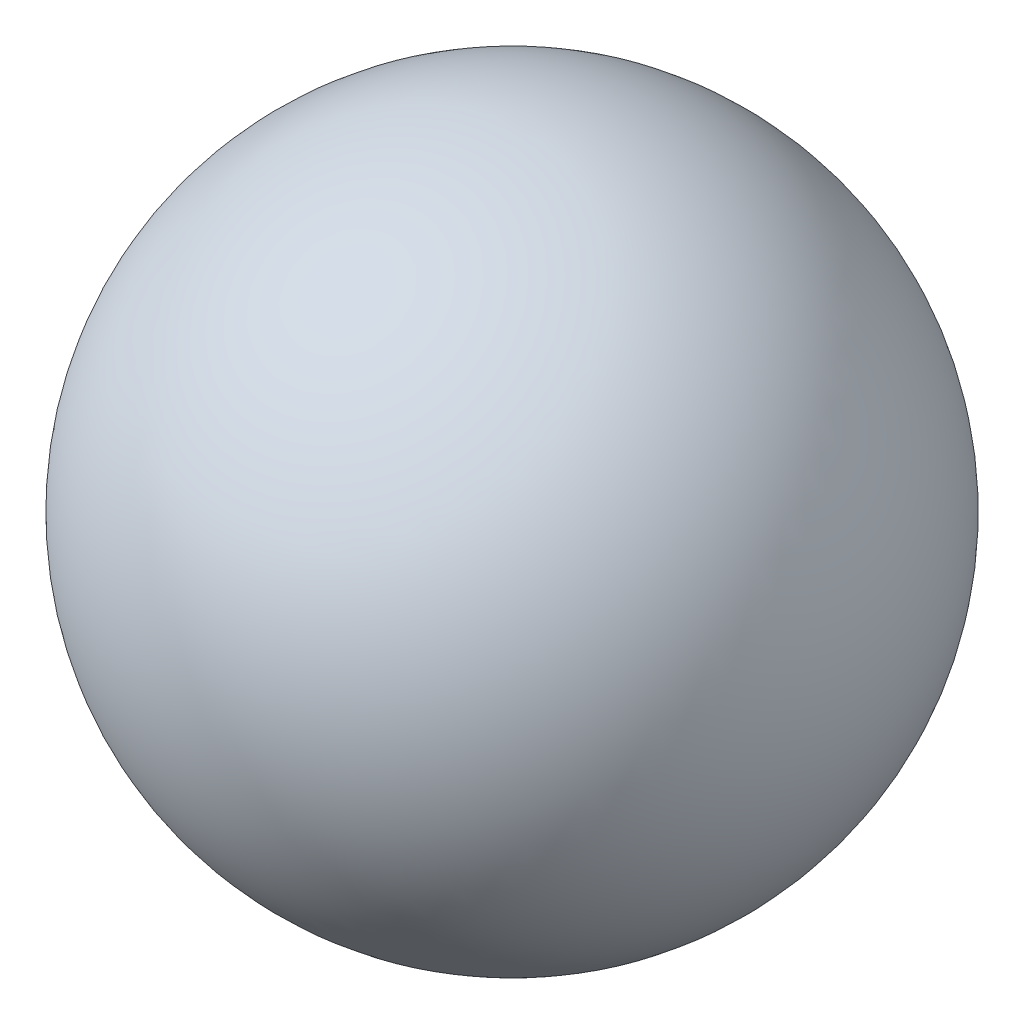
ISO-10303-21;
HEADER;
FILE_DESCRIPTION(('STEP AP214'),'2;1');
FILE_NAME('part.step','',(''),(''),'','','');
FILE_SCHEMA(('AUTOMOTIVE_DESIGN { 1 0 10303 214 1 1 1 1 }'));
ENDSEC;
DATA;
#1=APPLICATION_CONTEXT('core data for automotive mechanical design processes');
#2=APPLICATION_PROTOCOL_DEFINITION('international standard','automotive_design',2000,#1);
#3=PRODUCT_CONTEXT('',#1,'mechanical');
#4=PRODUCT('Part','Part','',(#3));
#5=PRODUCT_RELATED_PRODUCT_CATEGORY('part','',(#4));
#6=PRODUCT_DEFINITION_FORMATION('','',#4);
#7=PRODUCT_DEFINITION_CONTEXT('part definition',#1,'design');
#8=PRODUCT_DEFINITION('design','',#6,#7);
#9=PRODUCT_DEFINITION_SHAPE('','',#8);
#10=(LENGTH_UNIT() NAMED_UNIT(*) SI_UNIT(.MILLI.,.METRE.));
#11=(NAMED_UNIT(*) PLANE_ANGLE_UNIT() SI_UNIT($,.RADIAN.));
#12=(NAMED_UNIT(*) SI_UNIT($,.STERADIAN.) SOLID_ANGLE_UNIT());
#13=UNCERTAINTY_MEASURE_WITH_UNIT(LENGTH_MEASURE(1.E-05),#10,'distance_accuracy_value','');
#14=(GEOMETRIC_REPRESENTATION_CONTEXT(3) GLOBAL_UNCERTAINTY_ASSIGNED_CONTEXT((#13)) GLOBAL_UNIT_ASSIGNED_CONTEXT((#10,
#11,#12)) REPRESENTATION_CONTEXT('',''));
#15=CARTESIAN_POINT('',(0.,0.,0.));
#16=DIRECTION('',(0.,0.,1.));
#17=DIRECTION('',(1.,0.,0.));
#18=AXIS2_PLACEMENT_3D('',#15,#16,#17);
#19=CARTESIAN_POINT('',(0.,0.,0.));
#20=DIRECTION('',(0.,1.,0.));
#21=DIRECTION('',(1.,0.,0.));
#22=AXIS2_PLACEMENT_3D('',#19,#20,#21);
#23=SPHERICAL_SURFACE('',#22,3.1242);
#24=CARTESIAN_POINT('',(0.,3.1242,0.));
#25=VERTEX_POINT('',#24);
#26=VERTEX_LOOP('',#25);
#27=FACE_BOUND('',#26,.T.);
#28=ADVANCED_FACE('F31',(#27),#23,.T.);
#29=CLOSED_SHELL('',(#28));
#30=MANIFOLD_SOLID_BREP('B2',#29);
#31=ADVANCED_BREP_SHAPE_REPRESENTATION('',(#18,#30),#14);
#32=SHAPE_DEFINITION_REPRESENTATION(#9,#31);
ENDSEC;
END-ISO-10303-21;
